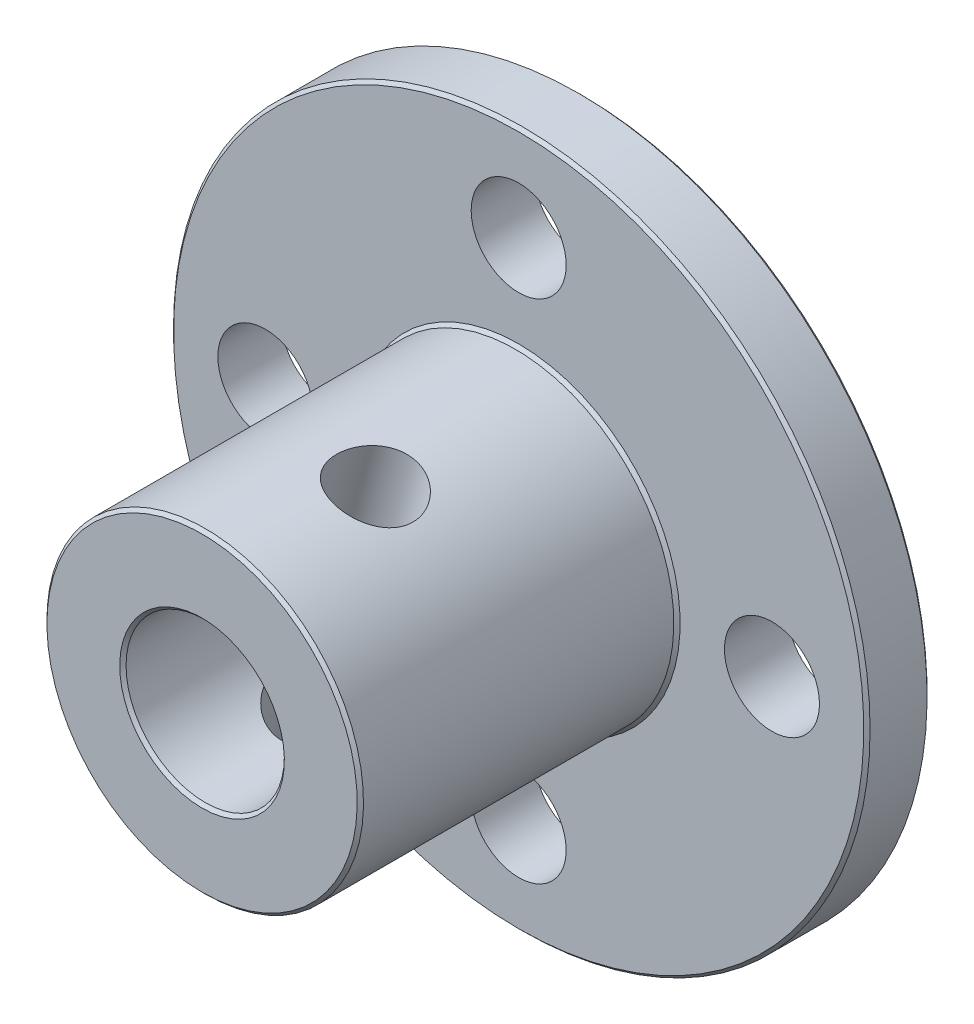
ISO-10303-21;
HEADER;
FILE_DESCRIPTION(('STEP AP214'),'2;1');
FILE_NAME('part.step','',(''),(''),'','','');
FILE_SCHEMA(('AUTOMOTIVE_DESIGN { 1 0 10303 214 1 1 1 1 }'));
ENDSEC;
DATA;
#1=APPLICATION_CONTEXT('core data for automotive mechanical design processes');
#2=APPLICATION_PROTOCOL_DEFINITION('international standard','automotive_design',2000,#1);
#3=PRODUCT_CONTEXT('',#1,'mechanical');
#4=PRODUCT('Part','Part','',(#3));
#5=PRODUCT_RELATED_PRODUCT_CATEGORY('part','',(#4));
#6=PRODUCT_DEFINITION_FORMATION('','',#4);
#7=PRODUCT_DEFINITION_CONTEXT('part definition',#1,'design');
#8=PRODUCT_DEFINITION('design','',#6,#7);
#9=PRODUCT_DEFINITION_SHAPE('','',#8);
#10=(LENGTH_UNIT() NAMED_UNIT(*) SI_UNIT(.MILLI.,.METRE.));
#11=(NAMED_UNIT(*) PLANE_ANGLE_UNIT() SI_UNIT($,.RADIAN.));
#12=(NAMED_UNIT(*) SI_UNIT($,.STERADIAN.) SOLID_ANGLE_UNIT());
#13=UNCERTAINTY_MEASURE_WITH_UNIT(LENGTH_MEASURE(1.E-05),#10,'distance_accuracy_value','');
#14=(GEOMETRIC_REPRESENTATION_CONTEXT(3) GLOBAL_UNCERTAINTY_ASSIGNED_CONTEXT((#13)) GLOBAL_UNIT_ASSIGNED_CONTEXT((#10,
#11,#12)) REPRESENTATION_CONTEXT('',''));
#15=CARTESIAN_POINT('',(0.,0.,0.));
#16=DIRECTION('',(0.,0.,1.));
#17=DIRECTION('',(1.,0.,0.));
#18=AXIS2_PLACEMENT_3D('',#15,#16,#17);
#19=CARTESIAN_POINT('',(0.,5.,12.));
#20=DIRECTION('',(0.,0.,1.));
#21=DIRECTION('',(0.,-1.,0.));
#22=AXIS2_PLACEMENT_3D('',#19,#20,#21);
#23=PLANE('',#22);
#24=CARTESIAN_POINT('',(0.,0.,12.));
#25=DIRECTION('',(0.,0.,1.));
#26=DIRECTION('',(0.,-1.,0.));
#27=AXIS2_PLACEMENT_3D('',#24,#25,#26);
#28=CIRCLE('',#27,4.89999999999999);
#29=CARTESIAN_POINT('',(0.,-4.89999999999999,12.));
#30=VERTEX_POINT('',#29);
#31=EDGE_CURVE('E80',#30,#30,#28,.T.);
#32=ORIENTED_EDGE('',*,*,#31,.T.);
#33=EDGE_LOOP('',(#32));
#34=FACE_BOUND('',#33,.T.);
#35=CARTESIAN_POINT('',(0.,0.,12.));
#36=DIRECTION('',(0.,0.,1.));
#37=DIRECTION('',(0.,-1.,0.));
#38=AXIS2_PLACEMENT_3D('',#35,#36,#37);
#39=CIRCLE('',#38,2.6);
#40=CARTESIAN_POINT('',(0.,-2.6,12.));
#41=VERTEX_POINT('',#40);
#42=EDGE_CURVE('E83',#41,#41,#39,.F.);
#43=ORIENTED_EDGE('',*,*,#42,.T.);
#44=EDGE_LOOP('',(#43));
#45=FACE_BOUND('',#44,.T.);
#46=ADVANCED_FACE('F47',(#34,#45),#23,.T.);
#47=CARTESIAN_POINT('',(0.,0.,0.));
#48=DIRECTION('',(0.,0.,-1.));
#49=DIRECTION('',(0.,1.,0.));
#50=AXIS2_PLACEMENT_3D('',#47,#48,#49);
#51=CYLINDRICAL_SURFACE('',#50,2.5);
#52=CARTESIAN_POINT('',(0.,0.,11.9));
#53=DIRECTION('',(0.,0.,1.));
#54=DIRECTION('',(0.,-1.,0.));
#55=AXIS2_PLACEMENT_3D('',#52,#53,#54);
#56=CIRCLE('',#55,2.5);
#57=CARTESIAN_POINT('',(0.,-2.5,11.9));
#58=VERTEX_POINT('',#57);
#59=EDGE_CURVE('E74',#58,#58,#56,.T.);
#60=ORIENTED_EDGE('',*,*,#59,.T.);
#61=EDGE_LOOP('',(#60));
#62=FACE_BOUND('',#61,.T.);
#63=CARTESIAN_POINT('',(0.,0.,0.100000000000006));
#64=DIRECTION('',(0.,0.,-1.));
#65=DIRECTION('',(0.,1.,0.));
#66=AXIS2_PLACEMENT_3D('',#63,#64,#65);
#67=CIRCLE('',#66,2.5);
#68=CARTESIAN_POINT('',(0.,2.5,0.100000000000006));
#69=VERTEX_POINT('',#68);
#70=EDGE_CURVE('E77',#69,#69,#67,.T.);
#71=ORIENTED_EDGE('',*,*,#70,.T.);
#72=EDGE_LOOP('',(#71));
#73=FACE_BOUND('',#72,.T.);
#74=CARTESIAN_POINT('',(0.,2.5,8.86949959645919));
#75=CARTESIAN_POINT('',(-0.0641282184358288,2.49999679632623,8.83202016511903));
#76=CARTESIAN_POINT('',(-0.125265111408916,2.49751626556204,8.78931946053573));
#77=CARTESIAN_POINT('',(-0.239868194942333,2.48913368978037,8.69468189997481));
#78=CARTESIAN_POINT('',(-0.293311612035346,2.48322173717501,8.6427186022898));
#79=CARTESIAN_POINT('',(-0.390771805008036,2.46976018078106,8.53078612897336));
#80=CARTESIAN_POINT('',(-0.434791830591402,2.46221114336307,8.47081972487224));
#81=CARTESIAN_POINT('',(-0.511688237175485,2.44738919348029,8.34412527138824));
#82=CARTESIAN_POINT('',(-0.544576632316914,2.44011599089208,8.27740461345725));
#83=CARTESIAN_POINT('',(-0.596616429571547,2.42791016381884,8.14100905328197));
#84=CARTESIAN_POINT('',(-0.616173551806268,2.42291011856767,8.07149689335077));
#85=CARTESIAN_POINT('',(-0.641789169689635,2.41625610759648,7.92989172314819));
#86=CARTESIAN_POINT('',(-0.647862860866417,2.4145983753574,7.85780171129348));
#87=CARTESIAN_POINT('',(-0.646167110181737,2.41504852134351,7.72291892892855));
#88=CARTESIAN_POINT('',(-0.640043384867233,2.41670881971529,7.66009770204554));
#89=CARTESIAN_POINT('',(-0.617543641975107,2.42255505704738,7.53644365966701));
#90=CARTESIAN_POINT('',(-0.601165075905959,2.42674162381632,7.47561134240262));
#91=CARTESIAN_POINT('',(-0.559193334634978,2.43675181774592,7.35785367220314));
#92=CARTESIAN_POINT('',(-0.533661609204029,2.44256447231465,7.30090520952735));
#93=CARTESIAN_POINT('',(-0.474428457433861,2.45475667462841,7.19150612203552));
#94=CARTESIAN_POINT('',(-0.440723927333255,2.4611364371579,7.13905721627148));
#95=CARTESIAN_POINT('',(-0.361601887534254,2.47407317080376,7.03333490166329));
#96=CARTESIAN_POINT('',(-0.315255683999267,2.48055626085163,6.98074627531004));
#97=CARTESIAN_POINT('',(-0.21489380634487,2.49125845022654,6.88316292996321));
#98=CARTESIAN_POINT('',(-0.160873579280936,2.49547619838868,6.83817275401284));
#99=CARTESIAN_POINT('',(-0.0425058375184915,2.50038728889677,6.75397041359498));
#100=CARTESIAN_POINT('',(0.022299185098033,2.50081429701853,6.71538010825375));
#101=CARTESIAN_POINT('',(0.15721617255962,2.49596208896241,6.64946703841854));
#102=CARTESIAN_POINT('',(0.227324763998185,2.49068647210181,6.62213718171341));
#103=CARTESIAN_POINT('',(0.365608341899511,2.47403448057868,6.58145992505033));
#104=CARTESIAN_POINT('',(0.433593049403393,2.4630951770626,6.56729136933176));
#105=CARTESIAN_POINT('',(0.569746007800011,2.43520154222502,6.55060764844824));
#106=CARTESIAN_POINT('',(0.637914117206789,2.41825097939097,6.54808519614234));
#107=CARTESIAN_POINT('',(0.766031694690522,2.3806002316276,6.55451117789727));
#108=CARTESIAN_POINT('',(0.826172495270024,2.36036831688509,6.56245821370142));
#109=CARTESIAN_POINT('',(0.942996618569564,2.31617320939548,6.58774798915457));
#110=CARTESIAN_POINT('',(0.999679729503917,2.29220978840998,6.60509130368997));
#111=CARTESIAN_POINT('',(1.10887384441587,2.2414424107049,6.64870007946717));
#112=CARTESIAN_POINT('',(1.16133782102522,2.21461260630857,6.67505244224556));
#113=CARTESIAN_POINT('',(1.26062057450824,2.15964362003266,6.73578159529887));
#114=CARTESIAN_POINT('',(1.30743740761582,2.13150399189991,6.77016113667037));
#115=CARTESIAN_POINT('',(1.39897465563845,2.07270308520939,6.84964665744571));
#116=CARTESIAN_POINT('',(1.44309259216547,2.04205132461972,6.89545388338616));
#117=CARTESIAN_POINT('',(1.52351683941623,1.98277519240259,6.99467185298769));
#118=CARTESIAN_POINT('',(1.55981706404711,1.95415241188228,7.04808846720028));
#119=CARTESIAN_POINT('',(1.62633909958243,1.89921194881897,7.16536470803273));
#120=CARTESIAN_POINT('',(1.65599080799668,1.87317713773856,7.22968419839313));
#121=CARTESIAN_POINT('',(1.7052876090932,1.8284181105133,7.36441229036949));
#122=CARTESIAN_POINT('',(1.72494240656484,1.80968680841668,7.43481490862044));
#123=CARTESIAN_POINT('',(1.75254972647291,1.78295147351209,7.57422733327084));
#124=CARTESIAN_POINT('',(1.76126503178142,1.77425217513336,7.64295009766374));
#125=CARTESIAN_POINT('',(1.76922647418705,1.76631694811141,7.78146268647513));
#126=CARTESIAN_POINT('',(1.76847997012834,1.76707366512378,7.85125163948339));
#127=CARTESIAN_POINT('',(1.7581908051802,1.77730168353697,7.98153162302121));
#128=CARTESIAN_POINT('',(1.74964624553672,1.78578392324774,8.0421860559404));
#129=CARTESIAN_POINT('',(1.72541803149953,1.80920262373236,8.16075450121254));
#130=CARTESIAN_POINT('',(1.7097320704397,1.82414116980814,8.21866762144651));
#131=CARTESIAN_POINT('',(1.67080720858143,1.85987225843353,8.33281637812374));
#132=CARTESIAN_POINT('',(1.64728746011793,1.88087788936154,8.38888839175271));
#133=CARTESIAN_POINT('',(1.59328903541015,1.92683323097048,8.49582300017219));
#134=CARTESIAN_POINT('',(1.5628068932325,1.95178490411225,8.54668298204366));
#135=CARTESIAN_POINT('',(1.49090678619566,2.00736413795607,8.64849694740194));
#136=CARTESIAN_POINT('',(1.44859290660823,2.03831035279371,8.69864769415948));
#137=CARTESIAN_POINT('',(1.35595428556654,2.10107547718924,8.79030948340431));
#138=CARTESIAN_POINT('',(1.30562648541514,2.13289471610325,8.83181721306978));
#139=CARTESIAN_POINT('',(1.19587680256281,2.19636443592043,8.90616777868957));
#140=CARTESIAN_POINT('',(1.13621790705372,2.22797784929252,8.93869555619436));
#141=CARTESIAN_POINT('',(1.01029863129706,2.28782404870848,8.99190489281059));
#142=CARTESIAN_POINT('',(0.944044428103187,2.31605994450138,9.01259741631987));
#143=CARTESIAN_POINT('',(0.813076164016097,2.36502642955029,9.03977807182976));
#144=CARTESIAN_POINT('',(0.7487591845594,2.38620356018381,9.04737601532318));
#145=CARTESIAN_POINT('',(0.618263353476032,2.42329219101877,9.05147903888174));
#146=CARTESIAN_POINT('',(0.552084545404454,2.43920381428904,9.04798437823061));
#147=CARTESIAN_POINT('',(0.424645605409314,2.46447009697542,9.03071083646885));
#148=CARTESIAN_POINT('',(0.363358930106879,2.47419909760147,9.01765245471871));
#149=CARTESIAN_POINT('',(0.242884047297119,2.4889117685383,8.98265009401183));
#150=CARTESIAN_POINT('',(0.183693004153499,2.49390210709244,8.96071866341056));
#151=CARTESIAN_POINT('',(0.0831082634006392,2.49899420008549,8.91523066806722));
#152=CARTESIAN_POINT('',(0.0409444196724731,2.50000204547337,8.89342936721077));
#153=CARTESIAN_POINT('',(0.,2.5,8.86949959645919));
#154=B_SPLINE_CURVE_WITH_KNOTS('',3,(#74,#75,#76,#77,#78,#79,#80,#81,#82,#83,#84,#85,#86,#87,
#88,#89,#90,#91,#92,#93,#94,#95,#96,#97,#98,#99,#100,#101,#102,#103,#104,#105,#106,#107,#108,
#109,#110,#111,#112,#113,#114,#115,#116,#117,#118,#119,#120,#121,#122,#123,#124,#125,#126,#127,
#128,#129,#130,#131,#132,#133,#134,#135,#136,#137,#138,#139,#140,#141,#142,#143,#144,#145,#146,
#147,#148,#149,#150,#151,#152,#153),.UNSPECIFIED.,.T.,.F.,(4,2,2,2,2,2,2,2,2,2,2,2,2,2,2,2,2,2,
2,2,2,2,2,2,2,2,2,2,2,2,2,2,2,2,2,2,2,2,2,4),(0.,0.222672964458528,0.445992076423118,
0.669234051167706,0.892234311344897,1.1081021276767,1.32372654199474,1.51221891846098,
1.70075815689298,1.88805463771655,2.0754223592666,2.28572271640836,2.49614836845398,
2.72125056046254,2.94621075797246,3.15594543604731,3.36554886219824,3.55648865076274,
3.74744012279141,3.94028807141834,4.13320221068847,4.34410361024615,4.55516860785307,
4.78037297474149,5.00535829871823,5.21358087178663,5.42164151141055,5.60631655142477,
5.79105128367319,5.98328784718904,6.1756203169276,6.39230171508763,6.60906601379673,
6.83267622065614,7.05607893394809,7.25939616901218,7.46270865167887,7.65210117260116,
7.84122678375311,7.98339844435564),.UNSPECIFIED.);
#155=CARTESIAN_POINT('',(0.,2.5,8.86949959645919));
#156=VERTEX_POINT('',#155);
#157=EDGE_CURVE('E130',#156,#156,#154,.T.);
#158=ORIENTED_EDGE('',*,*,#157,.F.);
#159=EDGE_LOOP('',(#158));
#160=FACE_BOUND('',#159,.T.);
#161=CARTESIAN_POINT('',(-1.76776695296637,-1.76776695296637,7.8));
#162=CARTESIAN_POINT('',(-1.76776403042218,-1.76777361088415,7.86513476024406));
#163=CARTESIAN_POINT('',(-1.76358886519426,-1.77197573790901,7.9303517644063));
#164=CARTESIAN_POINT('',(-1.7470287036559,-1.78830012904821,8.05878408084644));
#165=CARTESIAN_POINT('',(-1.73462645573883,-1.80043903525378,8.12199489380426));
#166=CARTESIAN_POINT('',(-1.70208010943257,-1.83123386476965,8.24431458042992));
#167=CARTESIAN_POINT('',(-1.68197715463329,-1.84985510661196,8.30344331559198));
#168=CARTESIAN_POINT('',(-1.63445563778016,-1.89197246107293,8.41678025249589));
#169=CARTESIAN_POINT('',(-1.60703667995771,-1.91546883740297,8.47098818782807));
#170=CARTESIAN_POINT('',(-1.54268577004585,-1.96773329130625,8.57788216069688));
#171=CARTESIAN_POINT('',(-1.50515572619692,-1.99677633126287,8.63007391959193));
#172=CARTESIAN_POINT('',(-1.42231975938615,-2.05660340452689,8.72676048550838));
#173=CARTESIAN_POINT('',(-1.37700998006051,-2.08738829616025,8.7712514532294));
#174=CARTESIAN_POINT('',(-1.27576736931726,-2.15086450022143,8.85420893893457));
#175=CARTESIAN_POINT('',(-1.21932434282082,-2.18354444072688,8.89206720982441));
#176=CARTESIAN_POINT('',(-1.09907543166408,-2.24646938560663,8.9564260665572));
#177=CARTESIAN_POINT('',(-1.03527422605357,-2.27671591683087,8.98293382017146));
#178=CARTESIAN_POINT('',(-0.906694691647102,-2.3307544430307,9.02188082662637));
#179=CARTESIAN_POINT('',(-0.842308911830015,-2.35485257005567,9.03518690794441));
#180=CARTESIAN_POINT('',(-0.710546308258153,-2.39789828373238,9.05020764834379));
#181=CARTESIAN_POINT('',(-0.643171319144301,-2.4168489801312,9.05192932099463));
#182=CARTESIAN_POINT('',(-0.51366821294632,-2.44748622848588,9.04406665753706));
#183=CARTESIAN_POINT('',(-0.451593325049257,-2.45966116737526,9.03545248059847));
#184=CARTESIAN_POINT('',(-0.328690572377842,-2.47907926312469,9.00889894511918));
#185=CARTESIAN_POINT('',(-0.267862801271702,-2.48632205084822,8.99095888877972));
#186=CARTESIAN_POINT('',(-0.14826343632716,-2.49633183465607,8.94614679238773));
#187=CARTESIAN_POINT('',(-0.0895319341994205,-2.49903551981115,8.91915460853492));
#188=CARTESIAN_POINT('',(0.0235901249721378,-2.50052962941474,8.85717072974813));
#189=CARTESIAN_POINT('',(0.0779791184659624,-2.49931865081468,8.82217617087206));
#190=CARTESIAN_POINT('',(0.186141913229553,-2.49370286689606,8.74138081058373));
#191=CARTESIAN_POINT('',(0.23937157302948,-2.48900697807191,8.69487121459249));
#192=CARTESIAN_POINT('',(0.337905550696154,-2.47755633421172,8.59426284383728));
#193=CARTESIAN_POINT('',(0.383203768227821,-2.47080000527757,8.54015828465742));
#194=CARTESIAN_POINT('',(0.467037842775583,-2.45637933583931,8.42168975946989));
#195=CARTESIAN_POINT('',(0.504961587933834,-2.44868457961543,8.35689247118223));
#196=CARTESIAN_POINT('',(0.568353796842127,-2.43475622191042,8.22132791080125));
#197=CARTESIAN_POINT('',(0.593835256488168,-2.42852109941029,8.15056695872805));
#198=CARTESIAN_POINT('',(0.62917626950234,-2.41959650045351,8.01098186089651));
#199=CARTESIAN_POINT('',(0.640113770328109,-2.41666520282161,7.94244860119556));
#200=CARTESIAN_POINT('',(0.649161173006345,-2.41425294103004,7.80449832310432));
#201=CARTESIAN_POINT('',(0.64728013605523,-2.41476953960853,7.73508196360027));
#202=CARTESIAN_POINT('',(0.631773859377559,-2.41886514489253,7.60543260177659));
#203=CARTESIAN_POINT('',(0.619455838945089,-2.42210296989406,7.54502568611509));
#204=CARTESIAN_POINT('',(0.585502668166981,-2.4305329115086,7.4270402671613));
#205=CARTESIAN_POINT('',(0.563864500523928,-2.43572566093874,7.36946268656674));
#206=CARTESIAN_POINT('',(0.511048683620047,-2.4473638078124,7.25573583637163));
#207=CARTESIAN_POINT('',(0.479475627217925,-2.45385608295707,7.19977622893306));
#208=CARTESIAN_POINT('',(0.408346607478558,-2.46668978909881,7.09316341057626));
#209=CARTESIAN_POINT('',(0.368786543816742,-2.47303114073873,7.0425129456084));
#210=CARTESIAN_POINT('',(0.277317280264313,-2.48505103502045,6.94127654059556));
#211=CARTESIAN_POINT('',(0.224480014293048,-2.49054526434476,6.89150356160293));
#212=CARTESIAN_POINT('',(0.111484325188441,-2.49815476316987,6.80073470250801));
#213=CARTESIAN_POINT('',(0.0513234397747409,-2.50026889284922,6.75974178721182));
#214=CARTESIAN_POINT('',(-0.0763957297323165,-2.49966848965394,6.68678284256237));
#215=CARTESIAN_POINT('',(-0.144107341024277,-2.4968250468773,6.65508360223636));
#216=CARTESIAN_POINT('',(-0.28338390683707,-2.4848665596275,6.60357762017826));
#217=CARTESIAN_POINT('',(-0.354945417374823,-2.47575703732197,6.58376043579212));
#218=CARTESIAN_POINT('',(-0.492655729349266,-2.45188098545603,6.55828929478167));
#219=CARTESIAN_POINT('',(-0.558698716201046,-2.43771019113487,6.55150265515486));
#220=CARTESIAN_POINT('',(-0.689595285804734,-2.40395915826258,6.548945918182));
#221=CARTESIAN_POINT('',(-0.75444927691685,-2.38438081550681,6.55317196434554));
#222=CARTESIAN_POINT('',(-0.87671756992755,-2.34206741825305,6.57177050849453));
#223=CARTESIAN_POINT('',(-0.934340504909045,-2.31962538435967,6.58545606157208));
#224=CARTESIAN_POINT('',(-1.04539806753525,-2.27173990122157,6.62165874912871));
#225=CARTESIAN_POINT('',(-1.098832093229,-2.24629602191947,6.64417715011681));
#226=CARTESIAN_POINT('',(-1.2027203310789,-2.19249465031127,6.69840881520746));
#227=CARTESIAN_POINT('',(-1.25294934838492,-2.16405908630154,6.73047415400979));
#228=CARTESIAN_POINT('',(-1.34713081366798,-2.10672341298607,6.80244741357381));
#229=CARTESIAN_POINT('',(-1.3910803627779,-2.07782309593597,6.84235893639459));
#230=CARTESIAN_POINT('',(-1.47631609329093,-2.01828013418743,6.93349642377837));
#231=CARTESIAN_POINT('',(-1.5169019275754,-1.98775032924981,6.98545310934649));
#232=CARTESIAN_POINT('',(-1.58955148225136,-1.9301505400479,7.09681340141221));
#233=CARTESIAN_POINT('',(-1.62160766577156,-1.90308362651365,7.1562235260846));
#234=CARTESIAN_POINT('',(-1.67754702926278,-1.85398702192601,7.28329580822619));
#235=CARTESIAN_POINT('',(-1.70113991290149,-1.83214354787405,7.35115941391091));
#236=CARTESIAN_POINT('',(-1.73797966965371,-1.79724433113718,7.49166550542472));
#237=CARTESIAN_POINT('',(-1.75126114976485,-1.78415921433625,7.56429111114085));
#238=CARTESIAN_POINT('',(-1.76201447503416,-1.77350367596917,7.66475669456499));
#239=CARTESIAN_POINT('',(-1.76416908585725,-1.771358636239,7.69170986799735));
#240=CARTESIAN_POINT('',(-1.76704598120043,-1.76848884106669,7.7457706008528));
#241=CARTESIAN_POINT('',(-1.767768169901,-1.7677641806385,7.77287817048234));
#242=CARTESIAN_POINT('',(-1.76776695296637,-1.76776695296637,7.8));
#243=B_SPLINE_CURVE_WITH_KNOTS('',3,(#161,#162,#163,#164,#165,#166,#167,#168,#169,#170,#171,
#172,#173,#174,#175,#176,#177,#178,#179,#180,#181,#182,#183,#184,#185,#186,#187,#188,#189,#190,
#191,#192,#193,#194,#195,#196,#197,#198,#199,#200,#201,#202,#203,#204,#205,#206,#207,#208,#209,
#210,#211,#212,#213,#214,#215,#216,#217,#218,#219,#220,#221,#222,#223,#224,#225,#226,#227,#228,
#229,#230,#231,#232,#233,#234,#235,#236,#237,#238,#239,#240,#241,#242),.UNSPECIFIED.,.T.,.F.,(4,
2,2,2,2,2,2,2,2,2,2,2,2,2,2,2,2,2,2,2,2,2,2,2,2,2,2,2,2,2,2,2,2,2,2,2,2,2,2,2,4),(0.,
0.195290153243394,0.390991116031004,0.585660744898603,0.780340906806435,0.991077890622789,
1.20191963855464,1.42697365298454,1.65188533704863,1.86079356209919,2.0695752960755,
2.26020121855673,2.45084140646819,2.64411918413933,2.8374662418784,3.04908989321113,
3.26087560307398,3.4861105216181,3.71110967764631,3.91827863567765,4.12530116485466,
4.30967729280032,4.49411315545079,4.68709120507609,4.88016857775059,5.09758429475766,
5.31507331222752,5.53830226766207,5.76133474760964,5.96390337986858,6.16640108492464,
6.35555531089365,6.54473666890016,6.7420093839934,6.93937287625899,7.15637802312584,
7.37357428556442,7.59763436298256,7.8209391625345,7.90225168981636,7.98356965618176),.UNSPECIFIED.);
#244=CARTESIAN_POINT('',(-1.76776695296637,-1.76776695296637,7.8));
#245=VERTEX_POINT('',#244);
#246=EDGE_CURVE('E101',#245,#245,#243,.T.);
#247=ORIENTED_EDGE('',*,*,#246,.F.);
#248=EDGE_LOOP('',(#247));
#249=FACE_BOUND('',#248,.T.);
#250=ADVANCED_FACE('F135',(#62,#73,#160,#249),#51,.F.);
#251=CARTESIAN_POINT('',(0.,2.5,0.));
#252=DIRECTION('',(0.,0.,-1.));
#253=DIRECTION('',(0.,1.,0.));
#254=AXIS2_PLACEMENT_3D('',#251,#252,#253);
#255=PLANE('',#254);
#256=CARTESIAN_POINT('',(0.,0.,0.));
#257=DIRECTION('',(0.,0.,-1.));
#258=DIRECTION('',(0.,1.,0.));
#259=AXIS2_PLACEMENT_3D('',#256,#257,#258);
#260=CIRCLE('',#259,10.9);
#261=CARTESIAN_POINT('',(0.,10.9,0.));
#262=VERTEX_POINT('',#261);
#263=EDGE_CURVE('E10',#262,#262,#260,.T.);
#264=ORIENTED_EDGE('',*,*,#263,.T.);
#265=EDGE_LOOP('',(#264));
#266=FACE_BOUND('',#265,.T.);
#267=CARTESIAN_POINT('',(0.,0.,0.));
#268=DIRECTION('',(0.,0.,-1.));
#269=DIRECTION('',(0.,1.,0.));
#270=AXIS2_PLACEMENT_3D('',#267,#268,#269);
#271=CIRCLE('',#270,2.60000000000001);
#272=CARTESIAN_POINT('',(0.,2.60000000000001,0.));
#273=VERTEX_POINT('',#272);
#274=EDGE_CURVE('E55',#273,#273,#271,.F.);
#275=ORIENTED_EDGE('',*,*,#274,.T.);
#276=EDGE_LOOP('',(#275));
#277=FACE_BOUND('',#276,.T.);
#278=CARTESIAN_POINT('',(8.,0.,0.));
#279=DIRECTION('',(0.,0.,-1.));
#280=DIRECTION('',(1.,0.,0.));
#281=AXIS2_PLACEMENT_3D('',#278,#279,#280);
#282=CIRCLE('',#281,1.5);
#283=CARTESIAN_POINT('',(9.5,0.,0.));
#284=VERTEX_POINT('',#283);
#285=EDGE_CURVE('E203',#284,#284,#282,.T.);
#286=ORIENTED_EDGE('',*,*,#285,.F.);
#287=EDGE_LOOP('',(#286));
#288=FACE_BOUND('',#287,.T.);
#289=CARTESIAN_POINT('',(0.,-8.,0.));
#290=DIRECTION('',(0.,0.,-1.));
#291=DIRECTION('',(0.,-1.,0.));
#292=AXIS2_PLACEMENT_3D('',#289,#290,#291);
#293=CIRCLE('',#292,1.5);
#294=CARTESIAN_POINT('',(0.,-9.5,0.));
#295=VERTEX_POINT('',#294);
#296=EDGE_CURVE('E207',#295,#295,#293,.T.);
#297=ORIENTED_EDGE('',*,*,#296,.F.);
#298=EDGE_LOOP('',(#297));
#299=FACE_BOUND('',#298,.T.);
#300=CARTESIAN_POINT('',(-8.,0.,0.));
#301=DIRECTION('',(0.,0.,-1.));
#302=DIRECTION('',(-1.,0.,0.));
#303=AXIS2_PLACEMENT_3D('',#300,#301,#302);
#304=CIRCLE('',#303,1.5);
#305=CARTESIAN_POINT('',(-9.5,0.,0.));
#306=VERTEX_POINT('',#305);
#307=EDGE_CURVE('E211',#306,#306,#304,.T.);
#308=ORIENTED_EDGE('',*,*,#307,.F.);
#309=EDGE_LOOP('',(#308));
#310=FACE_BOUND('',#309,.T.);
#311=CARTESIAN_POINT('',(0.,8.,0.));
#312=DIRECTION('',(0.,0.,-1.));
#313=DIRECTION('',(0.,1.,0.));
#314=AXIS2_PLACEMENT_3D('',#311,#312,#313);
#315=CIRCLE('',#314,1.5);
#316=CARTESIAN_POINT('',(0.,9.5,0.));
#317=VERTEX_POINT('',#316);
#318=EDGE_CURVE('E92',#317,#317,#315,.T.);
#319=ORIENTED_EDGE('',*,*,#318,.F.);
#320=EDGE_LOOP('',(#319));
#321=FACE_BOUND('',#320,.T.);
#322=ADVANCED_FACE('F140',(#266,#277,#288,#299,#310,#321),#255,.T.);
#323=CARTESIAN_POINT('',(0.,0.,0.));
#324=DIRECTION('',(0.,0.,-1.));
#325=DIRECTION('',(0.,1.,0.));
#326=AXIS2_PLACEMENT_3D('',#323,#324,#325);
#327=CYLINDRICAL_SURFACE('',#326,11.);
#328=CARTESIAN_POINT('',(0.,0.,1.9));
#329=DIRECTION('',(0.,0.,1.));
#330=DIRECTION('',(0.,-1.,0.));
#331=AXIS2_PLACEMENT_3D('',#328,#329,#330);
#332=CIRCLE('',#331,11.);
#333=CARTESIAN_POINT('',(0.,-11.,1.9));
#334=VERTEX_POINT('',#333);
#335=EDGE_CURVE('E59',#334,#334,#332,.F.);
#336=ORIENTED_EDGE('',*,*,#335,.T.);
#337=EDGE_LOOP('',(#336));
#338=FACE_BOUND('',#337,.T.);
#339=CARTESIAN_POINT('',(0.,0.,0.0999999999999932));
#340=DIRECTION('',(0.,0.,-1.));
#341=DIRECTION('',(0.,1.,0.));
#342=AXIS2_PLACEMENT_3D('',#339,#340,#341);
#343=CIRCLE('',#342,11.);
#344=CARTESIAN_POINT('',(0.,11.,0.0999999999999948));
#345=VERTEX_POINT('',#344);
#346=EDGE_CURVE('E63',#345,#345,#343,.F.);
#347=ORIENTED_EDGE('',*,*,#346,.T.);
#348=EDGE_LOOP('',(#347));
#349=FACE_BOUND('',#348,.T.);
#350=ADVANCED_FACE('F186',(#338,#349),#327,.T.);
#351=CARTESIAN_POINT('',(0.,11.,2.));
#352=DIRECTION('',(0.,0.,1.));
#353=DIRECTION('',(0.,-1.,0.));
#354=AXIS2_PLACEMENT_3D('',#351,#352,#353);
#355=PLANE('',#354);
#356=CARTESIAN_POINT('',(0.,0.,2.));
#357=DIRECTION('',(0.,0.,1.));
#358=DIRECTION('',(0.,-1.,0.));
#359=AXIS2_PLACEMENT_3D('',#356,#357,#358);
#360=CIRCLE('',#359,5.10000000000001);
#361=CARTESIAN_POINT('',(0.,-5.10000000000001,2.));
#362=VERTEX_POINT('',#361);
#363=EDGE_CURVE('E68',#362,#362,#360,.F.);
#364=ORIENTED_EDGE('',*,*,#363,.T.);
#365=EDGE_LOOP('',(#364));
#366=FACE_BOUND('',#365,.T.);
#367=CARTESIAN_POINT('',(0.,0.,2.));
#368=DIRECTION('',(0.,0.,1.));
#369=DIRECTION('',(0.,-1.,0.));
#370=AXIS2_PLACEMENT_3D('',#367,#368,#369);
#371=CIRCLE('',#370,10.9);
#372=CARTESIAN_POINT('',(0.,-10.9,2.));
#373=VERTEX_POINT('',#372);
#374=EDGE_CURVE('E71',#373,#373,#371,.T.);
#375=ORIENTED_EDGE('',*,*,#374,.T.);
#376=EDGE_LOOP('',(#375));
#377=FACE_BOUND('',#376,.T.);
#378=CARTESIAN_POINT('',(8.,0.,2.));
#379=DIRECTION('',(0.,0.,1.));
#380=DIRECTION('',(0.,-1.,0.));
#381=AXIS2_PLACEMENT_3D('',#378,#379,#380);
#382=CIRCLE('',#381,1.5);
#383=CARTESIAN_POINT('',(8.,-1.50000000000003,2.));
#384=VERTEX_POINT('',#383);
#385=EDGE_CURVE('E227',#384,#384,#382,.F.);
#386=ORIENTED_EDGE('',*,*,#385,.T.);
#387=EDGE_LOOP('',(#386));
#388=FACE_BOUND('',#387,.T.);
#389=CARTESIAN_POINT('',(0.,-8.,2.));
#390=DIRECTION('',(0.,0.,1.));
#391=DIRECTION('',(0.,-1.,0.));
#392=AXIS2_PLACEMENT_3D('',#389,#390,#391);
#393=CIRCLE('',#392,1.5);
#394=CARTESIAN_POINT('',(0.,-9.5,2.));
#395=VERTEX_POINT('',#394);
#396=EDGE_CURVE('E223',#395,#395,#393,.F.);
#397=ORIENTED_EDGE('',*,*,#396,.T.);
#398=EDGE_LOOP('',(#397));
#399=FACE_BOUND('',#398,.T.);
#400=CARTESIAN_POINT('',(-8.,0.,2.));
#401=DIRECTION('',(0.,0.,1.));
#402=DIRECTION('',(0.,-1.,0.));
#403=AXIS2_PLACEMENT_3D('',#400,#401,#402);
#404=CIRCLE('',#403,1.5);
#405=CARTESIAN_POINT('',(-8.,-1.49999999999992,2.));
#406=VERTEX_POINT('',#405);
#407=EDGE_CURVE('E219',#406,#406,#404,.F.);
#408=ORIENTED_EDGE('',*,*,#407,.T.);
#409=EDGE_LOOP('',(#408));
#410=FACE_BOUND('',#409,.T.);
#411=CARTESIAN_POINT('',(0.,8.,2.));
#412=DIRECTION('',(0.,0.,1.));
#413=DIRECTION('',(0.,-1.,0.));
#414=AXIS2_PLACEMENT_3D('',#411,#412,#413);
#415=CIRCLE('',#414,1.5);
#416=CARTESIAN_POINT('',(0.,6.5,2.));
#417=VERTEX_POINT('',#416);
#418=EDGE_CURVE('E215',#417,#417,#415,.F.);
#419=ORIENTED_EDGE('',*,*,#418,.T.);
#420=EDGE_LOOP('',(#419));
#421=FACE_BOUND('',#420,.T.);
#422=ADVANCED_FACE('F188',(#366,#377,#388,#399,#410,#421),#355,.T.);
#423=CARTESIAN_POINT('',(0.,0.,0.));
#424=DIRECTION('',(0.,0.,-1.));
#425=DIRECTION('',(0.,1.,0.));
#426=AXIS2_PLACEMENT_3D('',#423,#424,#425);
#427=CYLINDRICAL_SURFACE('',#426,5.);
#428=CARTESIAN_POINT('',(0.,0.,11.9));
#429=DIRECTION('',(0.,0.,1.));
#430=DIRECTION('',(0.,-1.,0.));
#431=AXIS2_PLACEMENT_3D('',#428,#429,#430);
#432=CIRCLE('',#431,5.);
#433=CARTESIAN_POINT('',(0.,-5.,11.9));
#434=VERTEX_POINT('',#433);
#435=EDGE_CURVE('E86',#434,#434,#432,.F.);
#436=ORIENTED_EDGE('',*,*,#435,.T.);
#437=EDGE_LOOP('',(#436));
#438=FACE_BOUND('',#437,.T.);
#439=CARTESIAN_POINT('',(0.,0.,2.10000000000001));
#440=DIRECTION('',(0.,0.,1.));
#441=DIRECTION('',(0.,-1.,0.));
#442=AXIS2_PLACEMENT_3D('',#439,#440,#441);
#443=CIRCLE('',#442,5.);
#444=CARTESIAN_POINT('',(0.,-5.,2.10000000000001));
#445=VERTEX_POINT('',#444);
#446=EDGE_CURVE('E89',#445,#445,#443,.T.);
#447=ORIENTED_EDGE('',*,*,#446,.T.);
#448=EDGE_LOOP('',(#447));
#449=FACE_BOUND('',#448,.T.);
#450=CARTESIAN_POINT('',(-2.46040959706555,-4.35274449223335,7.8));
#451=CARTESIAN_POINT('',(-2.46040804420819,-4.35274627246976,7.73097462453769));
#452=CARTESIAN_POINT('',(-2.45525444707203,-4.35567080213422,7.661927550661));
#453=CARTESIAN_POINT('',(-2.43477611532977,-4.36714990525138,7.52581621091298));
#454=CARTESIAN_POINT('',(-2.4194454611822,-4.3757077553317,7.45875312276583));
#455=CARTESIAN_POINT('',(-2.37904476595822,-4.39780303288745,7.32859823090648));
#456=CARTESIAN_POINT('',(-2.35398729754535,-4.41133403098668,7.26550142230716));
#457=CARTESIAN_POINT('',(-2.29474028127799,-4.4424409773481,7.14484457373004));
#458=CARTESIAN_POINT('',(-2.26055034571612,-4.46001709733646,7.08728476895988));
#459=CARTESIAN_POINT('',(-2.18303032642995,-4.49847559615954,6.97806917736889));
#460=CARTESIAN_POINT('',(-2.13953234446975,-4.51941665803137,6.92655319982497));
#461=CARTESIAN_POINT('',(-2.0447746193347,-4.56307062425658,6.83211930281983));
#462=CARTESIAN_POINT('',(-1.99351415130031,-4.58578369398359,6.78920218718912));
#463=CARTESIAN_POINT('',(-1.88361009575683,-4.63202017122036,6.71261226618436));
#464=CARTESIAN_POINT('',(-1.82487346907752,-4.65555046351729,6.67907680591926));
#465=CARTESIAN_POINT('',(-1.70205379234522,-4.70184148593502,6.62309517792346));
#466=CARTESIAN_POINT('',(-1.63797153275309,-4.72460232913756,6.60064737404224));
#467=CARTESIAN_POINT('',(-1.50754549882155,-4.767801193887,6.5679260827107));
#468=CARTESIAN_POINT('',(-1.44127383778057,-4.78827693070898,6.55741517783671));
#469=CARTESIAN_POINT('',(-1.30717366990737,-4.82660925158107,6.54812081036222));
#470=CARTESIAN_POINT('',(-1.23934539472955,-4.84446622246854,6.5493356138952));
#471=CARTESIAN_POINT('',(-1.10566522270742,-4.87669252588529,6.56328742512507));
#472=CARTESIAN_POINT('',(-1.03980286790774,-4.8911304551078,6.57576816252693));
#473=CARTESIAN_POINT('',(-0.910425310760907,-4.91685659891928,6.61148563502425));
#474=CARTESIAN_POINT('',(-0.846910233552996,-4.9281446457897,6.6347229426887));
#475=CARTESIAN_POINT('',(-0.723473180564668,-4.94778044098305,6.69150128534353));
#476=CARTESIAN_POINT('',(-0.663588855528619,-4.956100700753,6.72513352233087));
#477=CARTESIAN_POINT('',(-0.549722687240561,-4.97002014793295,6.80167783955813));
#478=CARTESIAN_POINT('',(-0.495741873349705,-4.97561886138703,6.84459153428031));
#479=CARTESIAN_POINT('',(-0.393846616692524,-4.98473426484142,6.93985437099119));
#480=CARTESIAN_POINT('',(-0.34613589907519,-4.98819050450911,6.99242744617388));
#481=CARTESIAN_POINT('',(-0.260032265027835,-4.99342059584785,7.10479998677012));
#482=CARTESIAN_POINT('',(-0.221639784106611,-4.99519436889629,7.1645997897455));
#483=CARTESIAN_POINT('',(-0.155306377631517,-4.99769868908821,7.29014501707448));
#484=CARTESIAN_POINT('',(-0.127417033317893,-4.99842413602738,7.3559178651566));
#485=CARTESIAN_POINT('',(-0.0834130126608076,-4.99935315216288,7.49129273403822));
#486=CARTESIAN_POINT('',(-0.0672958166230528,-4.99955683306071,7.56089393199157));
#487=CARTESIAN_POINT('',(-0.0477508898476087,-4.9997813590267,7.69997975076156));
#488=CARTESIAN_POINT('',(-0.0439992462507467,-4.99980689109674,7.76941889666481));
#489=CARTESIAN_POINT('',(-0.0484262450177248,-4.99976597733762,7.90791096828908));
#490=CARTESIAN_POINT('',(-0.0566037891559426,-4.99969953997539,7.97696392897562));
#491=CARTESIAN_POINT('',(-0.0843265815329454,-4.99930735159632,8.11155713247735));
#492=CARTESIAN_POINT('',(-0.103683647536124,-4.99898586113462,8.17713636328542));
#493=CARTESIAN_POINT('',(-0.152906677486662,-4.99772166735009,8.30421572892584));
#494=CARTESIAN_POINT('',(-0.182773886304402,-4.99677889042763,8.36571537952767));
#495=CARTESIAN_POINT('',(-0.25269884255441,-4.9937347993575,8.48422063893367));
#496=CARTESIAN_POINT('',(-0.292945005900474,-4.99161112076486,8.54111442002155));
#497=CARTESIAN_POINT('',(-0.382056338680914,-4.98558152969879,8.64759418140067));
#498=CARTESIAN_POINT('',(-0.430922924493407,-4.98167532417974,8.69717895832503));
#499=CARTESIAN_POINT('',(-0.53715625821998,-4.97135557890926,8.78890552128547));
#500=CARTESIAN_POINT('',(-0.594705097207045,-4.96488174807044,8.8308300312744));
#501=CARTESIAN_POINT('',(-0.715625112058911,-4.94889829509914,8.90446793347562));
#502=CARTESIAN_POINT('',(-0.778995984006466,-4.93938883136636,8.9361818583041));
#503=CARTESIAN_POINT('',(-0.909166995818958,-4.91708650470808,8.98822301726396));
#504=CARTESIAN_POINT('',(-0.975938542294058,-4.90431826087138,9.00863214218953));
#505=CARTESIAN_POINT('',(-1.11128337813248,-4.87543146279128,9.03773016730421));
#506=CARTESIAN_POINT('',(-1.17985631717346,-4.85931355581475,9.04642132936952));
#507=CARTESIAN_POINT('',(-1.31483254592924,-4.82451476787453,9.05170948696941));
#508=CARTESIAN_POINT('',(-1.38124436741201,-4.80591496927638,9.04862713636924));
#509=CARTESIAN_POINT('',(-1.51186934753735,-4.76643547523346,9.03119021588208));
#510=CARTESIAN_POINT('',(-1.57608257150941,-4.74555584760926,9.01683598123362));
#511=CARTESIAN_POINT('',(-1.70024374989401,-4.70249611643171,8.97743472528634));
#512=CARTESIAN_POINT('',(-1.76021280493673,-4.68032361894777,8.95244568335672));
#513=CARTESIAN_POINT('',(-1.87481274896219,-4.63560839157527,8.89253677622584));
#514=CARTESIAN_POINT('',(-1.92944296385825,-4.61306561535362,8.85761565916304));
#515=CARTESIAN_POINT('',(-2.03338085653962,-4.5682212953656,8.77785595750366));
#516=CARTESIAN_POINT('',(-2.08252966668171,-4.5459384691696,8.73279982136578));
#517=CARTESIAN_POINT('',(-2.17288671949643,-4.50344998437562,8.63447143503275));
#518=CARTESIAN_POINT('',(-2.21409294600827,-4.48324485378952,8.58119710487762));
#519=CARTESIAN_POINT('',(-2.28833749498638,-4.44581561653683,8.46674823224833));
#520=CARTESIAN_POINT('',(-2.32120909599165,-4.42865415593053,8.40544484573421));
#521=CARTESIAN_POINT('',(-2.3769442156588,-4.3989930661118,8.27743063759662));
#522=CARTESIAN_POINT('',(-2.39981501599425,-4.3864900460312,8.21072379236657));
#523=CARTESIAN_POINT('',(-2.43164163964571,-4.36891071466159,8.0867787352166));
#524=CARTESIAN_POINT('',(-2.44241034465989,-4.36287741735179,8.03013354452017));
#525=CARTESIAN_POINT('',(-2.45679466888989,-4.3547937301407,7.91566391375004));
#526=CARTESIAN_POINT('',(-2.460410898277,-4.3527430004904,7.85783957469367));
#527=CARTESIAN_POINT('',(-2.46040959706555,-4.35274449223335,7.8));
#528=B_SPLINE_CURVE_WITH_KNOTS('',3,(#450,#451,#452,#453,#454,#455,#456,#457,#458,#459,#460,
#461,#462,#463,#464,#465,#466,#467,#468,#469,#470,#471,#472,#473,#474,#475,#476,#477,#478,#479,
#480,#481,#482,#483,#484,#485,#486,#487,#488,#489,#490,#491,#492,#493,#494,#495,#496,#497,#498,
#499,#500,#501,#502,#503,#504,#505,#506,#507,#508,#509,#510,#511,#512,#513,#514,#515,#516,#517,
#518,#519,#520,#521,#522,#523,#524,#525,#526,#527),.UNSPECIFIED.,.T.,.F.,(4,2,2,2,2,2,2,2,2,2,2,
2,2,2,2,2,2,2,2,2,2,2,2,2,2,2,2,2,2,2,2,2,2,2,2,2,2,2,4),(0.,0.206863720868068,
0.413847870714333,0.620565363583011,0.827291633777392,1.03811977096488,1.24896760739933,
1.4627574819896,1.67651579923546,1.88594375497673,2.0953407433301,2.30009131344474,
2.50485278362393,2.71146437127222,2.91811192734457,3.13035233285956,3.34260265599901,
3.55588216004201,3.76911600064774,3.97671787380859,4.18430063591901,4.38848702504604,
4.59269760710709,4.80091422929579,5.00916509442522,5.22262665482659,5.43607707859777,
5.64796036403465,5.85980274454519,6.06591723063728,6.27202558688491,6.47702438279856,
6.68204902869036,6.89198548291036,7.10197515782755,7.31588238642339,7.5296336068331,
7.70298913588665,7.87632987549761),.UNSPECIFIED.);
#529=CARTESIAN_POINT('',(-2.46040959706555,-4.35274449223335,7.8));
#530=VERTEX_POINT('',#529);
#531=EDGE_CURVE('E93',#530,#530,#528,.T.);
#532=ORIENTED_EDGE('',*,*,#531,.F.);
#533=EDGE_LOOP('',(#532));
#534=FACE_BOUND('',#533,.T.);
#535=CARTESIAN_POINT('',(0.0455950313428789,4.99979210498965,7.8));
#536=CARTESIAN_POINT('',(0.0455972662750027,4.99979287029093,7.8690253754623));
#537=CARTESIAN_POINT('',(0.0515226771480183,4.99974878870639,7.938072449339));
#538=CARTESIAN_POINT('',(0.0749969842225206,4.99945081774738,8.07418378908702));
#539=CARTESIAN_POINT('',(0.0925526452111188,4.99919680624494,8.14124687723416));
#540=CARTESIAN_POINT('',(0.138588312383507,4.99813153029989,8.27140176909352));
#541=CARTESIAN_POINT('',(0.167054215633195,4.99732098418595,8.33449857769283));
#542=CARTESIAN_POINT('',(0.233917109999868,4.99463688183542,8.45515542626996));
#543=CARTESIAN_POINT('',(0.272314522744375,4.99276328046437,8.51271523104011));
#544=CARTESIAN_POINT('',(0.358678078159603,4.98730930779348,8.6219308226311));
#545=CARTESIAN_POINT('',(0.406818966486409,4.98369580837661,8.67344680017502));
#546=CARTESIAN_POINT('',(0.51070854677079,4.97412238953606,8.76788069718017));
#547=CARTESIAN_POINT('',(0.566457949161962,4.96816225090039,8.81079781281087));
#548=CARTESIAN_POINT('',(0.684755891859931,4.95325218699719,8.88738773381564));
#549=CARTESIAN_POINT('',(0.747388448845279,4.94426170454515,8.92092319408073));
#550=CARTESIAN_POINT('',(0.876898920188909,4.92294106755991,8.97690482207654));
#551=CARTESIAN_POINT('',(0.943776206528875,4.9106114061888,8.99935262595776));
#552=CARTESIAN_POINT('',(1.07832789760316,4.88280970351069,9.03207391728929));
#553=CARTESIAN_POINT('',(1.14595870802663,4.86740638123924,9.04258482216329));
#554=CARTESIAN_POINT('',(1.28125902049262,4.83355306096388,9.05187918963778));
#555=CARTESIAN_POINT('',(1.34892851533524,4.81510351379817,9.0506643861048));
#556=CARTESIAN_POINT('',(1.48081209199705,4.77617222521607,9.03671257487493));
#557=CARTESIAN_POINT('',(1.54506952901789,4.75574466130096,9.02423183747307));
#558=CARTESIAN_POINT('',(1.66997685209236,4.7133353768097,8.98851436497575));
#559=CARTESIAN_POINT('',(1.73062654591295,4.69135357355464,8.9652770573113));
#560=CARTESIAN_POINT('',(1.8473440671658,4.64664014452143,8.90849871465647));
#561=CARTESIAN_POINT('',(1.90336554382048,4.62390353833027,8.87486647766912));
#562=CARTESIAN_POINT('',(2.00893626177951,4.5790250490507,8.79832216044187));
#563=CARTESIAN_POINT('',(2.05848437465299,4.55688327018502,8.75540846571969));
#564=CARTESIAN_POINT('',(2.15128595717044,4.51382981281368,8.66014562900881));
#565=CARTESIAN_POINT('',(2.19433277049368,4.4929676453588,8.60757255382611));
#566=CARTESIAN_POINT('',(2.27151575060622,4.45444522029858,8.49520001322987));
#567=CARTESIAN_POINT('',(2.30565150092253,4.43678511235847,8.4354002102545));
#568=CARTESIAN_POINT('',(2.36435007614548,4.40578721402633,8.30985498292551));
#569=CARTESIAN_POINT('',(2.38886568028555,4.39247079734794,8.2440821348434));
#570=CARTESIAN_POINT('',(2.42743878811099,4.37127333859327,8.10870726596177));
#571=CARTESIAN_POINT('',(2.44149852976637,4.36339113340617,8.03910606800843));
#572=CARTESIAN_POINT('',(2.45853719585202,4.35381311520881,7.90002024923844));
#573=CARTESIAN_POINT('',(2.46179898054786,4.35195940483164,7.83058110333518));
#574=CARTESIAN_POINT('',(2.45794463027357,4.35413747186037,7.69208903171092));
#575=CARTESIAN_POINT('',(2.4508294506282,4.35816870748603,7.62303607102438));
#576=CARTESIAN_POINT('',(2.42662471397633,4.37169045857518,7.48844286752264));
#577=CARTESIAN_POINT('',(2.409700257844,4.38109057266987,7.42286363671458));
#578=CARTESIAN_POINT('',(2.36643976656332,4.40460726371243,7.29578427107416));
#579=CARTESIAN_POINT('',(2.3401026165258,4.41872439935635,7.23428462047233));
#580=CARTESIAN_POINT('',(2.27802378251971,4.45105061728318,7.11577936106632));
#581=CARTESIAN_POINT('',(2.24210774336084,4.46933453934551,7.05888557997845));
#582=CARTESIAN_POINT('',(2.16192026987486,4.50866842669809,6.95240581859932));
#583=CARTESIAN_POINT('',(2.1176474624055,4.52971884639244,6.90282104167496));
#584=CARTESIAN_POINT('',(2.02048682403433,4.5738983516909,6.81109447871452));
#585=CARTESIAN_POINT('',(1.96741115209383,4.59706626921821,6.76916996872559));
#586=CARTESIAN_POINT('',(1.85469962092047,4.64368420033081,6.69553206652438));
#587=CARTESIAN_POINT('',(1.79506410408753,4.66713419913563,6.66381814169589));
#588=CARTESIAN_POINT('',(1.67118153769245,4.71290532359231,6.61177698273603));
#589=CARTESIAN_POINT('',(1.60697156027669,4.73523347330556,6.59136785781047));
#590=CARTESIAN_POINT('',(1.47531609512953,4.77788919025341,6.56226983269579));
#591=CARTESIAN_POINT('',(1.40787123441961,4.79821714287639,6.55357867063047));
#592=CARTESIAN_POINT('',(1.27357899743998,4.83556862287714,6.54829051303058));
#593=CARTESIAN_POINT('',(1.20676477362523,4.85266663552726,6.55137286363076));
#594=CARTESIAN_POINT('',(1.07390047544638,4.8837888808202,6.56880978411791));
#595=CARTESIAN_POINT('',(1.00785037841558,4.89781320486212,6.58316401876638));
#596=CARTESIAN_POINT('',(0.878793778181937,4.92260297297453,6.62256527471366));
#597=CARTESIAN_POINT('',(0.815772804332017,4.93338555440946,6.64755431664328));
#598=CARTESIAN_POINT('',(0.694168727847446,4.95196100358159,6.70746322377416));
#599=CARTESIAN_POINT('',(0.635586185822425,4.95975349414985,6.74238434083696));
#600=CARTESIAN_POINT('',(0.523151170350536,4.97288612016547,6.82214404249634));
#601=CARTESIAN_POINT('',(0.46944563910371,4.97816303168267,6.86720017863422));
#602=CARTESIAN_POINT('',(0.369949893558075,4.98654545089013,6.96552856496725));
#603=CARTESIAN_POINT('',(0.324161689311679,4.98965040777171,7.01880289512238));
#604=CARTESIAN_POINT('',(0.24114940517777,4.99435801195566,7.13325176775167));
#605=CARTESIAN_POINT('',(0.204101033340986,4.99593155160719,7.19455515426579));
#606=CARTESIAN_POINT('',(0.141002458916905,4.99811185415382,7.32256936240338));
#607=CARTESIAN_POINT('',(0.114944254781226,4.99871932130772,7.38927620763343));
#608=CARTESIAN_POINT('',(0.078591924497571,4.99940848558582,7.51322126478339));
#609=CARTESIAN_POINT('',(0.0662493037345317,4.99956784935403,7.56986645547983));
#610=CARTESIAN_POINT('',(0.0497502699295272,4.99975933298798,7.68433608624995));
#611=CARTESIAN_POINT('',(0.0455931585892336,4.99979146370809,7.74216042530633));
#612=CARTESIAN_POINT('',(0.0455950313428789,4.99979210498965,7.8));
#613=B_SPLINE_CURVE_WITH_KNOTS('',3,(#535,#536,#537,#538,#539,#540,#541,#542,#543,#544,#545,
#546,#547,#548,#549,#550,#551,#552,#553,#554,#555,#556,#557,#558,#559,#560,#561,#562,#563,#564,
#565,#566,#567,#568,#569,#570,#571,#572,#573,#574,#575,#576,#577,#578,#579,#580,#581,#582,#583,
#584,#585,#586,#587,#588,#589,#590,#591,#592,#593,#594,#595,#596,#597,#598,#599,#600,#601,#602,
#603,#604,#605,#606,#607,#608,#609,#610,#611,#612),.UNSPECIFIED.,.T.,.F.,(4,2,2,2,2,2,2,2,2,2,2,
2,2,2,2,2,2,2,2,2,2,2,2,2,2,2,2,2,2,2,2,2,2,2,2,2,2,2,4),(0.,0.20686372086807,0.413847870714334,
0.62056536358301,0.827291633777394,1.03811977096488,1.24896760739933,1.4627574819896,
1.67651579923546,1.88594375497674,2.0953407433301,2.30009131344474,2.50485278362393,
2.71146437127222,2.91811192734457,3.13035233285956,3.34260265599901,3.55588216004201,
3.76911600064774,3.97671787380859,4.18430063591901,4.38848702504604,4.59269760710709,
4.80091422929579,5.00916509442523,5.2226266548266,5.43607707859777,5.64796036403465,
5.85980274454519,6.06591723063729,6.27202558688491,6.47702438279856,6.68204902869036,
6.89198548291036,7.10197515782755,7.31588238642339,7.5296336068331,7.70298913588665,
7.8763298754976),.UNSPECIFIED.);
#614=CARTESIAN_POINT('',(0.0455950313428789,4.99979210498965,7.8));
#615=VERTEX_POINT('',#614);
#616=EDGE_CURVE('E102',#615,#615,#613,.T.);
#617=ORIENTED_EDGE('',*,*,#616,.F.);
#618=EDGE_LOOP('',(#617));
#619=FACE_BOUND('',#618,.T.);
#620=ADVANCED_FACE('F107',(#438,#449,#534,#619),#427,.T.);
#621=CARTESIAN_POINT('',(0.,8.,12.001));
#622=DIRECTION('',(0.,0.,-1.));
#623=DIRECTION('',(0.,1.,0.));
#624=AXIS2_PLACEMENT_3D('',#621,#622,#623);
#625=CYLINDRICAL_SURFACE('',#624,1.5);
#626=ORIENTED_EDGE('',*,*,#418,.F.);
#627=EDGE_LOOP('',(#626));
#628=FACE_BOUND('',#627,.T.);
#629=ORIENTED_EDGE('',*,*,#318,.T.);
#630=EDGE_LOOP('',(#629));
#631=FACE_BOUND('',#630,.T.);
#632=ADVANCED_FACE('F250',(#628,#631),#625,.F.);
#633=CARTESIAN_POINT('',(-8.,0.,12.001));
#634=DIRECTION('',(0.,0.,-1.));
#635=DIRECTION('',(0.,1.,0.));
#636=AXIS2_PLACEMENT_3D('',#633,#634,#635);
#637=CYLINDRICAL_SURFACE('',#636,1.5);
#638=ORIENTED_EDGE('',*,*,#407,.F.);
#639=EDGE_LOOP('',(#638));
#640=FACE_BOUND('',#639,.T.);
#641=ORIENTED_EDGE('',*,*,#307,.T.);
#642=EDGE_LOOP('',(#641));
#643=FACE_BOUND('',#642,.T.);
#644=ADVANCED_FACE('F239',(#640,#643),#637,.F.);
#645=CARTESIAN_POINT('',(0.,-8.,12.001));
#646=DIRECTION('',(0.,0.,-1.));
#647=DIRECTION('',(0.,1.,0.));
#648=AXIS2_PLACEMENT_3D('',#645,#646,#647);
#649=CYLINDRICAL_SURFACE('',#648,1.5);
#650=ORIENTED_EDGE('',*,*,#396,.F.);
#651=EDGE_LOOP('',(#650));
#652=FACE_BOUND('',#651,.T.);
#653=ORIENTED_EDGE('',*,*,#296,.T.);
#654=EDGE_LOOP('',(#653));
#655=FACE_BOUND('',#654,.T.);
#656=ADVANCED_FACE('F231',(#652,#655),#649,.F.);
#657=CARTESIAN_POINT('',(8.,0.,12.001));
#658=DIRECTION('',(0.,0.,-1.));
#659=DIRECTION('',(0.,1.,0.));
#660=AXIS2_PLACEMENT_3D('',#657,#658,#659);
#661=CYLINDRICAL_SURFACE('',#660,1.5);
#662=ORIENTED_EDGE('',*,*,#385,.F.);
#663=EDGE_LOOP('',(#662));
#664=FACE_BOUND('',#663,.T.);
#665=ORIENTED_EDGE('',*,*,#285,.T.);
#666=EDGE_LOOP('',(#665));
#667=FACE_BOUND('',#666,.T.);
#668=ADVANCED_FACE('F118',(#664,#667),#661,.F.);
#669=CARTESIAN_POINT('',(-3.4868602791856,-13.0131397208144,7.8));
#670=DIRECTION('',(0.258819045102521,0.965925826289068,0.));
#671=DIRECTION('',(-0.965925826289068,0.258819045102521,0.));
#672=AXIS2_PLACEMENT_3D('',#669,#670,#671);
#673=CYLINDRICAL_SURFACE('',#672,1.25);
#674=ORIENTED_EDGE('',*,*,#157,.T.);
#675=EDGE_LOOP('',(#674));
#676=FACE_BOUND('',#675,.T.);
#677=ORIENTED_EDGE('',*,*,#616,.T.);
#678=EDGE_LOOP('',(#677));
#679=FACE_BOUND('',#678,.T.);
#680=ADVANCED_FACE('F116',(#676,#679),#673,.F.);
#681=ORIENTED_EDGE('',*,*,#246,.T.);
#682=EDGE_LOOP('',(#681));
#683=FACE_BOUND('',#682,.T.);
#684=ORIENTED_EDGE('',*,*,#531,.T.);
#685=EDGE_LOOP('',(#684));
#686=FACE_BOUND('',#685,.T.);
#687=ADVANCED_FACE('F111',(#683,#686),#673,.F.);
#688=CARTESIAN_POINT('',(0.,0.,11.9));
#689=DIRECTION('',(0.,0.,-1.));
#690=DIRECTION('',(0.,1.,0.));
#691=AXIS2_PLACEMENT_3D('',#688,#689,#690);
#692=CONICAL_SURFACE('',#691,5.,0.785398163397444);
#693=ORIENTED_EDGE('',*,*,#31,.F.);
#694=EDGE_LOOP('',(#693));
#695=FACE_BOUND('',#694,.T.);
#696=ORIENTED_EDGE('',*,*,#435,.F.);
#697=EDGE_LOOP('',(#696));
#698=FACE_BOUND('',#697,.T.);
#699=ADVANCED_FACE('F115',(#695,#698),#692,.T.);
#700=CARTESIAN_POINT('',(0.,0.,12.));
#701=DIRECTION('',(0.,0.,1.));
#702=DIRECTION('',(0.,-1.,0.));
#703=AXIS2_PLACEMENT_3D('',#700,#701,#702);
#704=CONICAL_SURFACE('',#703,2.6,0.785398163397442);
#705=ORIENTED_EDGE('',*,*,#59,.F.);
#706=EDGE_LOOP('',(#705));
#707=FACE_BOUND('',#706,.T.);
#708=ORIENTED_EDGE('',*,*,#42,.F.);
#709=EDGE_LOOP('',(#708));
#710=FACE_BOUND('',#709,.T.);
#711=ADVANCED_FACE('F153',(#707,#710),#704,.F.);
#712=CARTESIAN_POINT('',(0.,0.,2.));
#713=DIRECTION('',(0.,0.,-1.));
#714=DIRECTION('',(0.,1.,0.));
#715=AXIS2_PLACEMENT_3D('',#712,#713,#714);
#716=CONICAL_SURFACE('',#715,5.10000000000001,0.785398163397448);
#717=ORIENTED_EDGE('',*,*,#446,.F.);
#718=EDGE_LOOP('',(#717));
#719=FACE_BOUND('',#718,.T.);
#720=ORIENTED_EDGE('',*,*,#363,.F.);
#721=EDGE_LOOP('',(#720));
#722=FACE_BOUND('',#721,.T.);
#723=ADVANCED_FACE('F160',(#719,#722),#716,.T.);
#724=CARTESIAN_POINT('',(0.,0.,1.9));
#725=DIRECTION('',(0.,0.,-1.));
#726=DIRECTION('',(0.,1.,0.));
#727=AXIS2_PLACEMENT_3D('',#724,#725,#726);
#728=CONICAL_SURFACE('',#727,11.,0.785398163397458);
#729=ORIENTED_EDGE('',*,*,#374,.F.);
#730=EDGE_LOOP('',(#729));
#731=FACE_BOUND('',#730,.T.);
#732=ORIENTED_EDGE('',*,*,#335,.F.);
#733=EDGE_LOOP('',(#732));
#734=FACE_BOUND('',#733,.T.);
#735=ADVANCED_FACE('F167',(#731,#734),#728,.T.);
#736=CARTESIAN_POINT('',(0.,0.,0.));
#737=DIRECTION('',(0.,0.,1.));
#738=DIRECTION('',(0.,-1.,0.));
#739=AXIS2_PLACEMENT_3D('',#736,#737,#738);
#740=CONICAL_SURFACE('',#739,10.9,0.785398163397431);
#741=ORIENTED_EDGE('',*,*,#346,.F.);
#742=EDGE_LOOP('',(#741));
#743=FACE_BOUND('',#742,.T.);
#744=ORIENTED_EDGE('',*,*,#263,.F.);
#745=EDGE_LOOP('',(#744));
#746=FACE_BOUND('',#745,.T.);
#747=ADVANCED_FACE('F173',(#743,#746),#740,.T.);
#748=CARTESIAN_POINT('',(0.,0.,0.100000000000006));
#749=DIRECTION('',(0.,0.,-1.));
#750=DIRECTION('',(0.,1.,0.));
#751=AXIS2_PLACEMENT_3D('',#748,#749,#750);
#752=CONICAL_SURFACE('',#751,2.5,0.785398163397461);
#753=ORIENTED_EDGE('',*,*,#274,.F.);
#754=EDGE_LOOP('',(#753));
#755=FACE_BOUND('',#754,.T.);
#756=ORIENTED_EDGE('',*,*,#70,.F.);
#757=EDGE_LOOP('',(#756));
#758=FACE_BOUND('',#757,.T.);
#759=ADVANCED_FACE('F50',(#755,#758),#752,.F.);
#760=CLOSED_SHELL('',(#46,#250,#322,#350,#422,#620,#632,#644,#656,#668,#680,#687,#699,#711,#723,
#735,#747,#759));
#761=MANIFOLD_SOLID_BREP('B2',#760);
#762=ADVANCED_BREP_SHAPE_REPRESENTATION('',(#18,#761),#14);
#763=SHAPE_DEFINITION_REPRESENTATION(#9,#762);
ENDSEC;
END-ISO-10303-21;
